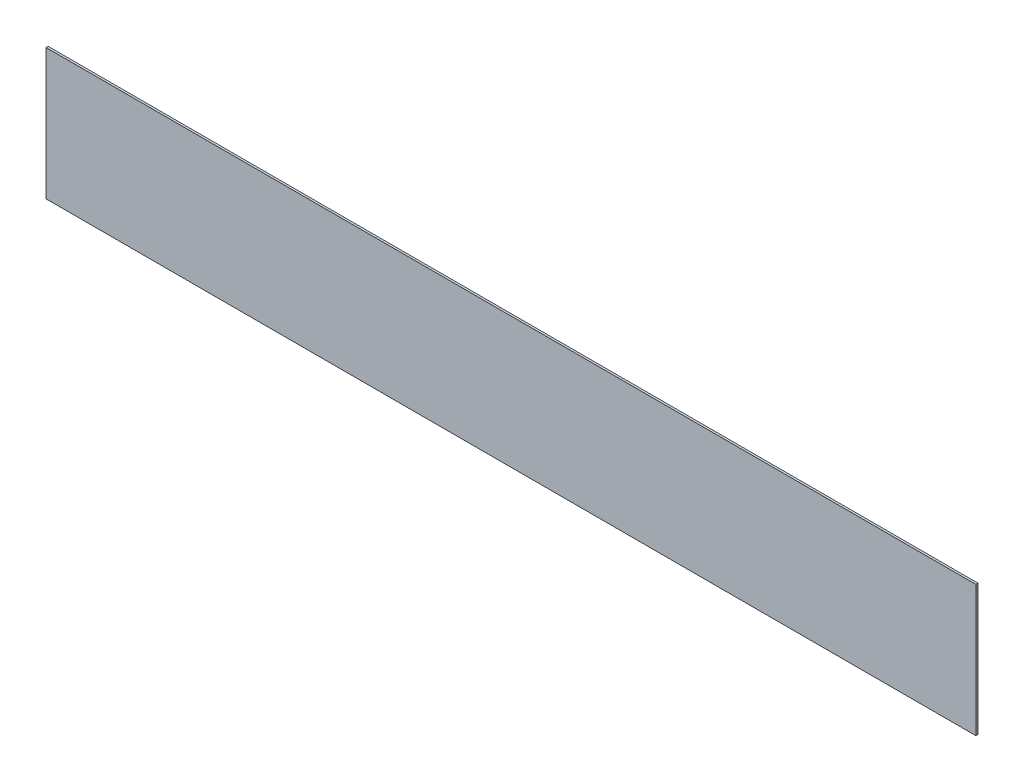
ISO-10303-21;
HEADER;
FILE_DESCRIPTION(('STEP AP214'),'2;1');
FILE_NAME('part.step','',(''),(''),'','','');
FILE_SCHEMA(('AUTOMOTIVE_DESIGN { 1 0 10303 214 1 1 1 1 }'));
ENDSEC;
DATA;
#1=APPLICATION_CONTEXT('core data for automotive mechanical design processes');
#2=APPLICATION_PROTOCOL_DEFINITION('international standard','automotive_design',2000,#1);
#3=PRODUCT_CONTEXT('',#1,'mechanical');
#4=PRODUCT('Part','Part','',(#3));
#5=PRODUCT_RELATED_PRODUCT_CATEGORY('part','',(#4));
#6=PRODUCT_DEFINITION_FORMATION('','',#4);
#7=PRODUCT_DEFINITION_CONTEXT('part definition',#1,'design');
#8=PRODUCT_DEFINITION('design','',#6,#7);
#9=PRODUCT_DEFINITION_SHAPE('','',#8);
#10=(LENGTH_UNIT() NAMED_UNIT(*) SI_UNIT(.MILLI.,.METRE.));
#11=(NAMED_UNIT(*) PLANE_ANGLE_UNIT() SI_UNIT($,.RADIAN.));
#12=(NAMED_UNIT(*) SI_UNIT($,.STERADIAN.) SOLID_ANGLE_UNIT());
#13=UNCERTAINTY_MEASURE_WITH_UNIT(LENGTH_MEASURE(1.E-05),#10,'distance_accuracy_value','');
#14=(GEOMETRIC_REPRESENTATION_CONTEXT(3) GLOBAL_UNCERTAINTY_ASSIGNED_CONTEXT((#13)) GLOBAL_UNIT_ASSIGNED_CONTEXT((#10,
#11,#12)) REPRESENTATION_CONTEXT('',''));
#15=CARTESIAN_POINT('',(0.,0.,0.));
#16=DIRECTION('',(0.,0.,1.));
#17=DIRECTION('',(1.,0.,0.));
#18=AXIS2_PLACEMENT_3D('',#15,#16,#17);
#19=CARTESIAN_POINT('',(0.,0.,0.5));
#20=DIRECTION('',(1.,0.,0.));
#21=DIRECTION('',(0.,0.,-1.));
#22=AXIS2_PLACEMENT_3D('',#19,#20,#21);
#23=PLANE('',#22);
#24=DIRECTION('',(0.,-1.,0.));
#25=VECTOR('',#24,1.);
#26=CARTESIAN_POINT('',(0.,0.,0.));
#27=LINE('',#26,#25);
#28=CARTESIAN_POINT('',(0.,31.,0.));
#29=VERTEX_POINT('',#28);
#30=CARTESIAN_POINT('',(0.,0.,0.));
#31=VERTEX_POINT('',#30);
#32=EDGE_CURVE('E94',#29,#31,#27,.T.);
#33=ORIENTED_EDGE('',*,*,#32,.T.);
#34=DIRECTION('',(0.,0.,-1.));
#35=VECTOR('',#34,1.);
#36=CARTESIAN_POINT('',(0.,0.,0.5));
#37=LINE('',#36,#35);
#38=CARTESIAN_POINT('',(0.,0.,0.5));
#39=VERTEX_POINT('',#38);
#40=EDGE_CURVE('E11',#39,#31,#37,.T.);
#41=ORIENTED_EDGE('',*,*,#40,.F.);
#42=DIRECTION('',(0.,-1.,0.));
#43=VECTOR('',#42,1.);
#44=CARTESIAN_POINT('',(0.,0.,0.5));
#45=LINE('',#44,#43);
#46=CARTESIAN_POINT('',(0.,31.,0.5));
#47=VERTEX_POINT('',#46);
#48=EDGE_CURVE('E82',#47,#39,#45,.T.);
#49=ORIENTED_EDGE('',*,*,#48,.F.);
#50=DIRECTION('',(0.,0.,-1.));
#51=VECTOR('',#50,1.);
#52=CARTESIAN_POINT('',(0.,31.,0.5));
#53=LINE('',#52,#51);
#54=EDGE_CURVE('E90',#47,#29,#53,.T.);
#55=ORIENTED_EDGE('',*,*,#54,.T.);
#56=EDGE_LOOP('',(#33,#41,#49,#55));
#57=FACE_BOUND('',#56,.T.);
#58=ADVANCED_FACE('F31',(#57),#23,.F.);
#59=CARTESIAN_POINT('',(0.,0.,0.5));
#60=DIRECTION('',(0.,1.,0.));
#61=DIRECTION('',(0.,0.,1.));
#62=AXIS2_PLACEMENT_3D('',#59,#60,#61);
#63=PLANE('',#62);
#64=DIRECTION('',(1.,0.,0.));
#65=VECTOR('',#64,1.);
#66=CARTESIAN_POINT('',(0.,0.,0.));
#67=LINE('',#66,#65);
#68=CARTESIAN_POINT('',(220.,0.,0.));
#69=VERTEX_POINT('',#68);
#70=EDGE_CURVE('E86',#31,#69,#67,.T.);
#71=ORIENTED_EDGE('',*,*,#70,.T.);
#72=DIRECTION('',(0.,0.,-1.));
#73=VECTOR('',#72,1.);
#74=CARTESIAN_POINT('',(220.,0.,0.5));
#75=LINE('',#74,#73);
#76=CARTESIAN_POINT('',(220.,0.,0.5));
#77=VERTEX_POINT('',#76);
#78=EDGE_CURVE('E39',#77,#69,#75,.T.);
#79=ORIENTED_EDGE('',*,*,#78,.F.);
#80=DIRECTION('',(1.,0.,0.));
#81=VECTOR('',#80,1.);
#82=CARTESIAN_POINT('',(0.,0.,0.5));
#83=LINE('',#82,#81);
#84=EDGE_CURVE('E77',#39,#77,#83,.T.);
#85=ORIENTED_EDGE('',*,*,#84,.F.);
#86=ORIENTED_EDGE('',*,*,#40,.T.);
#87=EDGE_LOOP('',(#71,#79,#85,#86));
#88=FACE_BOUND('',#87,.T.);
#89=ADVANCED_FACE('F85',(#88),#63,.F.);
#90=CARTESIAN_POINT('',(220.,0.,0.5));
#91=DIRECTION('',(-1.,0.,0.));
#92=DIRECTION('',(0.,0.,1.));
#93=AXIS2_PLACEMENT_3D('',#90,#91,#92);
#94=PLANE('',#93);
#95=DIRECTION('',(0.,1.,0.));
#96=VECTOR('',#95,1.);
#97=CARTESIAN_POINT('',(220.,0.,0.));
#98=LINE('',#97,#96);
#99=CARTESIAN_POINT('',(220.,31.,0.));
#100=VERTEX_POINT('',#99);
#101=EDGE_CURVE('E64',#69,#100,#98,.T.);
#102=ORIENTED_EDGE('',*,*,#101,.T.);
#103=DIRECTION('',(0.,0.,-1.));
#104=VECTOR('',#103,1.);
#105=CARTESIAN_POINT('',(220.,31.,0.5));
#106=LINE('',#105,#104);
#107=CARTESIAN_POINT('',(220.,31.,0.5));
#108=VERTEX_POINT('',#107);
#109=EDGE_CURVE('E87',#108,#100,#106,.T.);
#110=ORIENTED_EDGE('',*,*,#109,.F.);
#111=DIRECTION('',(0.,1.,0.));
#112=VECTOR('',#111,1.);
#113=CARTESIAN_POINT('',(220.,0.,0.5));
#114=LINE('',#113,#112);
#115=EDGE_CURVE('E80',#77,#108,#114,.T.);
#116=ORIENTED_EDGE('',*,*,#115,.F.);
#117=ORIENTED_EDGE('',*,*,#78,.T.);
#118=EDGE_LOOP('',(#102,#110,#116,#117));
#119=FACE_BOUND('',#118,.T.);
#120=ADVANCED_FACE('F88',(#119),#94,.F.);
#121=CARTESIAN_POINT('',(0.,31.,0.5));
#122=DIRECTION('',(0.,-1.,0.));
#123=DIRECTION('',(0.,0.,-1.));
#124=AXIS2_PLACEMENT_3D('',#121,#122,#123);
#125=PLANE('',#124);
#126=DIRECTION('',(-1.,0.,0.));
#127=VECTOR('',#126,1.);
#128=CARTESIAN_POINT('',(0.,31.,0.));
#129=LINE('',#128,#127);
#130=EDGE_CURVE('E70',#100,#29,#129,.T.);
#131=ORIENTED_EDGE('',*,*,#130,.T.);
#132=ORIENTED_EDGE('',*,*,#54,.F.);
#133=DIRECTION('',(-1.,0.,0.));
#134=VECTOR('',#133,1.);
#135=CARTESIAN_POINT('',(0.,31.,0.5));
#136=LINE('',#135,#134);
#137=EDGE_CURVE('E47',#108,#47,#136,.T.);
#138=ORIENTED_EDGE('',*,*,#137,.F.);
#139=ORIENTED_EDGE('',*,*,#109,.T.);
#140=EDGE_LOOP('',(#131,#132,#138,#139));
#141=FACE_BOUND('',#140,.T.);
#142=ADVANCED_FACE('F101',(#141),#125,.F.);
#143=CARTESIAN_POINT('',(0.,31.,0.5));
#144=DIRECTION('',(0.,0.,-1.));
#145=DIRECTION('',(-1.,0.,0.));
#146=AXIS2_PLACEMENT_3D('',#143,#144,#145);
#147=PLANE('',#146);
#148=ORIENTED_EDGE('',*,*,#48,.T.);
#149=ORIENTED_EDGE('',*,*,#84,.T.);
#150=ORIENTED_EDGE('',*,*,#115,.T.);
#151=ORIENTED_EDGE('',*,*,#137,.T.);
#152=EDGE_LOOP('',(#148,#149,#150,#151));
#153=FACE_BOUND('',#152,.T.);
#154=ADVANCED_FACE('F78',(#153),#147,.F.);
#155=CARTESIAN_POINT('',(0.,31.,0.));
#156=DIRECTION('',(0.,0.,-1.));
#157=DIRECTION('',(-1.,0.,0.));
#158=AXIS2_PLACEMENT_3D('',#155,#156,#157);
#159=PLANE('',#158);
#160=ORIENTED_EDGE('',*,*,#32,.F.);
#161=ORIENTED_EDGE('',*,*,#130,.F.);
#162=ORIENTED_EDGE('',*,*,#101,.F.);
#163=ORIENTED_EDGE('',*,*,#70,.F.);
#164=EDGE_LOOP('',(#160,#161,#162,#163));
#165=FACE_BOUND('',#164,.T.);
#166=ADVANCED_FACE('F104',(#165),#159,.T.);
#167=CLOSED_SHELL('',(#58,#89,#120,#142,#154,#166));
#168=MANIFOLD_SOLID_BREP('B2',#167);
#169=ADVANCED_BREP_SHAPE_REPRESENTATION('',(#18,#168),#14);
#170=SHAPE_DEFINITION_REPRESENTATION(#9,#169);
ENDSEC;
END-ISO-10303-21;
